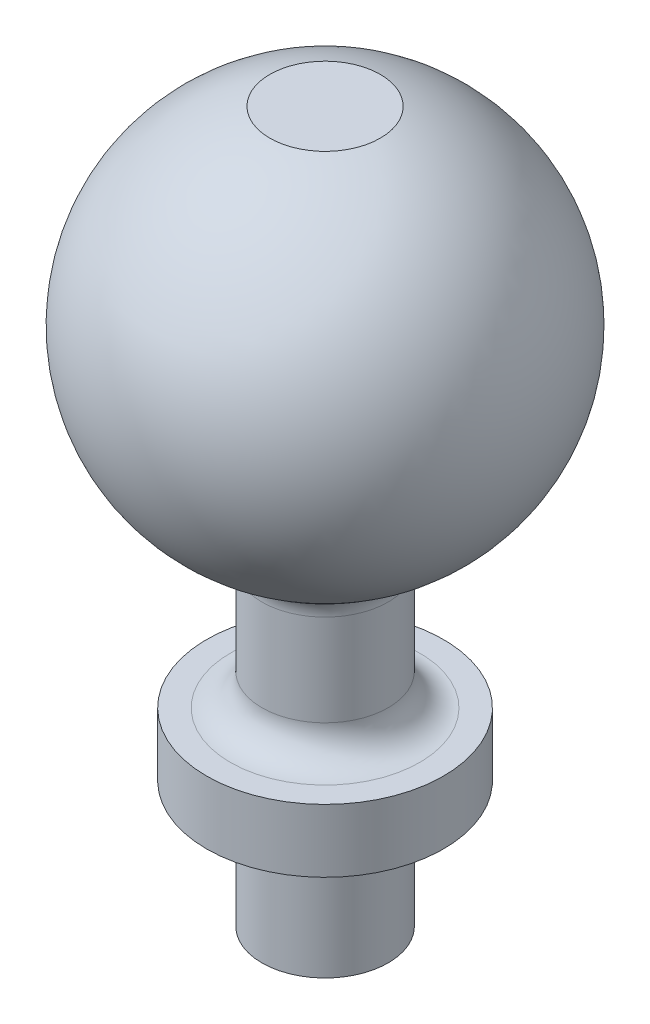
from build123d import *


with BuildPart() as part:
    # Sketch1 → Base-Revolve (revolve)
    with BuildSketch(Plane.XY, mode=Mode.PRIVATE) as base_revolve_sk:
        with BuildLine():
            Line((0, 45), (0, 0))
            Line((0, 0), (4, 0))
            Line((4, 0), (4, 8))
            Line((4, 8), (7.5, 8))
            Line((7.5, 8), (7.5, 12))
            Line((7.5, 12), (6, 12))
            ThreePointArc((6, 12), (4.585786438, 12.585786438), (4, 14))
            Line((4, 14), (4, 19.799621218))
            ThreePointArc((4, 19.799621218), (4.318457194, 20.882401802), (5.172413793, 21.620363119))
            ThreePointArc((5.172413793, 21.620363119), (12.468141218, 33.891882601), (3.5, 45))
            Line((3.5, 45), (0, 45))
        make_face()
    revolve(base_revolve_sk.sketch.rotate(Axis((0, 0, 0), (0, -1, 0)), 90), axis=Axis((0, 0, 0), (0, -1, 0)))


solid = part.part
